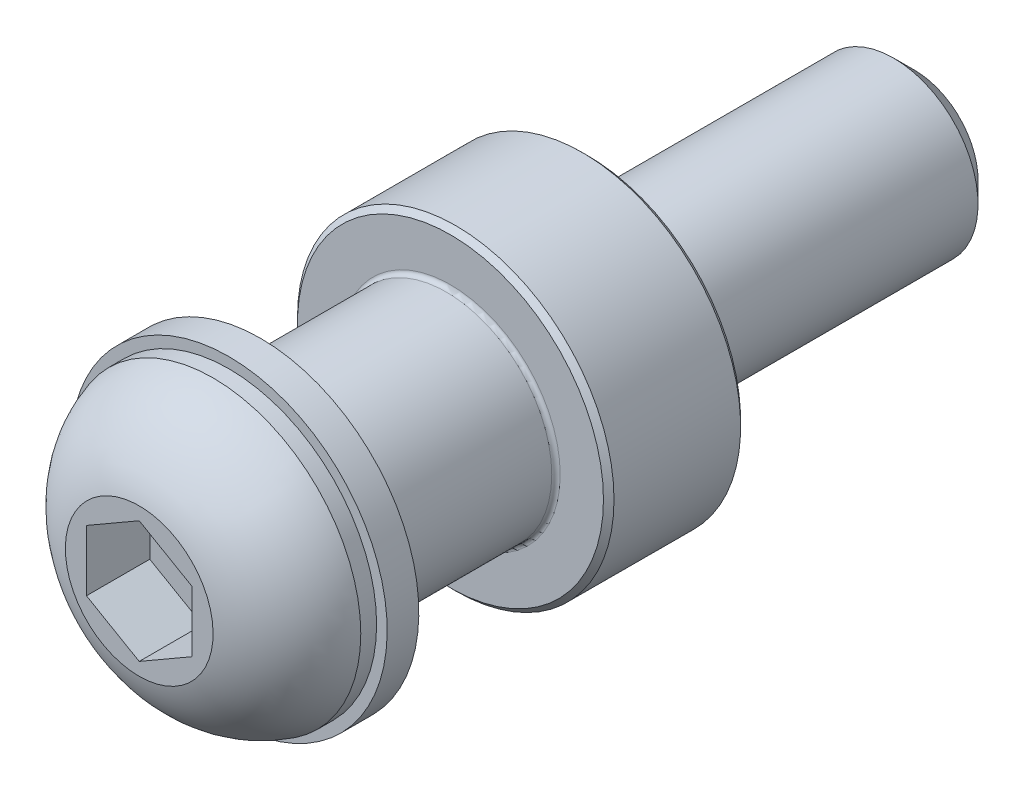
ISO-10303-21;
HEADER;
FILE_DESCRIPTION(('STEP AP214'),'2;1');
FILE_NAME('part.step','',(''),(''),'','','');
FILE_SCHEMA(('AUTOMOTIVE_DESIGN { 1 0 10303 214 1 1 1 1 }'));
ENDSEC;
DATA;
#1=APPLICATION_CONTEXT('core data for automotive mechanical design processes');
#2=APPLICATION_PROTOCOL_DEFINITION('international standard','automotive_design',2000,#1);
#3=PRODUCT_CONTEXT('',#1,'mechanical');
#4=PRODUCT('Part','Part','',(#3));
#5=PRODUCT_RELATED_PRODUCT_CATEGORY('part','',(#4));
#6=PRODUCT_DEFINITION_FORMATION('','',#4);
#7=PRODUCT_DEFINITION_CONTEXT('part definition',#1,'design');
#8=PRODUCT_DEFINITION('design','',#6,#7);
#9=PRODUCT_DEFINITION_SHAPE('','',#8);
#10=(LENGTH_UNIT() NAMED_UNIT(*) SI_UNIT(.MILLI.,.METRE.));
#11=(NAMED_UNIT(*) PLANE_ANGLE_UNIT() SI_UNIT($,.RADIAN.));
#12=(NAMED_UNIT(*) SI_UNIT($,.STERADIAN.) SOLID_ANGLE_UNIT());
#13=UNCERTAINTY_MEASURE_WITH_UNIT(LENGTH_MEASURE(1.E-05),#10,'distance_accuracy_value','');
#14=(GEOMETRIC_REPRESENTATION_CONTEXT(3) GLOBAL_UNCERTAINTY_ASSIGNED_CONTEXT((#13)) GLOBAL_UNIT_ASSIGNED_CONTEXT((#10,
#11,#12)) REPRESENTATION_CONTEXT('',''));
#15=CARTESIAN_POINT('',(0.,0.,0.));
#16=DIRECTION('',(0.,0.,1.));
#17=DIRECTION('',(1.,0.,0.));
#18=AXIS2_PLACEMENT_3D('',#15,#16,#17);
#19=CARTESIAN_POINT('',(0.,10.,13.));
#20=DIRECTION('',(0.,0.,1.));
#21=DIRECTION('',(1.,0.,0.));
#22=AXIS2_PLACEMENT_3D('',#19,#20,#21);
#23=PLANE('',#22);
#24=CARTESIAN_POINT('',(0.,0.,13.));
#25=DIRECTION('',(0.,0.,1.));
#26=DIRECTION('',(1.,0.,0.));
#27=AXIS2_PLACEMENT_3D('',#24,#25,#26);
#28=CIRCLE('',#27,14.5);
#29=CARTESIAN_POINT('',(14.5,0.,13.));
#30=VERTEX_POINT('',#29);
#31=EDGE_CURVE('E160',#30,#30,#28,.T.);
#32=ORIENTED_EDGE('',*,*,#31,.T.);
#33=EDGE_LOOP('',(#32));
#34=FACE_BOUND('',#33,.T.);
#35=CARTESIAN_POINT('',(0.,0.,13.));
#36=DIRECTION('',(0.,0.,1.));
#37=DIRECTION('',(1.,0.,0.));
#38=AXIS2_PLACEMENT_3D('',#35,#36,#37);
#39=CIRCLE('',#38,10.4);
#40=CARTESIAN_POINT('',(10.4,0.,13.));
#41=VERTEX_POINT('',#40);
#42=EDGE_CURVE('E143',#41,#41,#39,.F.);
#43=ORIENTED_EDGE('',*,*,#42,.T.);
#44=EDGE_LOOP('',(#43));
#45=FACE_BOUND('',#44,.T.);
#46=ADVANCED_FACE('F14',(#34,#45),#23,.T.);
#47=CARTESIAN_POINT('',(0.,0.,13.4));
#48=DIRECTION('',(0.,0.,1.));
#49=DIRECTION('',(1.,0.,0.));
#50=AXIS2_PLACEMENT_3D('',#47,#48,#49);
#51=TOROIDAL_SURFACE('',#50,10.4,0.4);
#52=CARTESIAN_POINT('',(0.,0.,13.4));
#53=DIRECTION('',(0.,0.,1.));
#54=DIRECTION('',(1.,0.,0.));
#55=AXIS2_PLACEMENT_3D('',#52,#53,#54);
#56=CIRCLE('',#55,10.);
#57=CARTESIAN_POINT('',(10.,0.,13.4));
#58=VERTEX_POINT('',#57);
#59=EDGE_CURVE('E148',#58,#58,#56,.T.);
#60=ORIENTED_EDGE('',*,*,#59,.F.);
#61=EDGE_LOOP('',(#60));
#62=FACE_BOUND('',#61,.T.);
#63=ORIENTED_EDGE('',*,*,#42,.F.);
#64=EDGE_LOOP('',(#63));
#65=FACE_BOUND('',#64,.T.);
#66=ADVANCED_FACE('F200',(#62,#65),#51,.F.);
#67=CARTESIAN_POINT('',(0.,0.,0.));
#68=DIRECTION('',(0.,0.,-1.));
#69=DIRECTION('',(-1.,0.,0.));
#70=AXIS2_PLACEMENT_3D('',#67,#68,#69);
#71=CYLINDRICAL_SURFACE('',#70,10.);
#72=CARTESIAN_POINT('',(0.,0.,30.));
#73=DIRECTION('',(0.,0.,1.));
#74=DIRECTION('',(1.,0.,0.));
#75=AXIS2_PLACEMENT_3D('',#72,#73,#74);
#76=CIRCLE('',#75,10.);
#77=CARTESIAN_POINT('',(10.,0.,30.));
#78=VERTEX_POINT('',#77);
#79=EDGE_CURVE('E23',#78,#78,#76,.F.);
#80=ORIENTED_EDGE('',*,*,#79,.T.);
#81=EDGE_LOOP('',(#80));
#82=FACE_BOUND('',#81,.T.);
#83=ORIENTED_EDGE('',*,*,#59,.T.);
#84=EDGE_LOOP('',(#83));
#85=FACE_BOUND('',#84,.T.);
#86=ADVANCED_FACE('F207',(#82,#85),#71,.T.);
#87=CARTESIAN_POINT('',(0.,0.,30.));
#88=DIRECTION('',(0.,0.,-1.));
#89=DIRECTION('',(-1.,0.,0.));
#90=AXIS2_PLACEMENT_3D('',#87,#88,#89);
#91=CONICAL_SURFACE('',#90,10.,0.785398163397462);
#92=CARTESIAN_POINT('',(0.,0.,30.5));
#93=DIRECTION('',(0.,0.,1.));
#94=DIRECTION('',(1.,0.,0.));
#95=AXIS2_PLACEMENT_3D('',#92,#93,#94);
#96=CIRCLE('',#95,9.5);
#97=CARTESIAN_POINT('',(9.5,0.,30.5));
#98=VERTEX_POINT('',#97);
#99=EDGE_CURVE('E9',#98,#98,#96,.T.);
#100=ORIENTED_EDGE('',*,*,#99,.F.);
#101=EDGE_LOOP('',(#100));
#102=FACE_BOUND('',#101,.T.);
#103=ORIENTED_EDGE('',*,*,#79,.F.);
#104=EDGE_LOOP('',(#103));
#105=FACE_BOUND('',#104,.T.);
#106=ADVANCED_FACE('F216',(#102,#105),#91,.T.);
#107=CARTESIAN_POINT('',(0.,8.2,30.5));
#108=DIRECTION('',(0.,0.,1.));
#109=DIRECTION('',(1.,0.,0.));
#110=AXIS2_PLACEMENT_3D('',#107,#108,#109);
#111=PLANE('',#110);
#112=ORIENTED_EDGE('',*,*,#99,.T.);
#113=EDGE_LOOP('',(#112));
#114=FACE_BOUND('',#113,.T.);
#115=CARTESIAN_POINT('',(0.,0.,30.5));
#116=DIRECTION('',(0.,0.,1.));
#117=DIRECTION('',(1.,0.,0.));
#118=AXIS2_PLACEMENT_3D('',#115,#116,#117);
#119=CIRCLE('',#118,8.);
#120=CARTESIAN_POINT('',(8.,0.,30.5));
#121=VERTEX_POINT('',#120);
#122=EDGE_CURVE('E138',#121,#121,#119,.F.);
#123=ORIENTED_EDGE('',*,*,#122,.T.);
#124=EDGE_LOOP('',(#123));
#125=FACE_BOUND('',#124,.T.);
#126=ADVANCED_FACE('F218',(#114,#125),#111,.T.);
#127=CARTESIAN_POINT('',(0.,0.,12.5));
#128=DIRECTION('',(0.,0.,-1.));
#129=DIRECTION('',(-1.,0.,0.));
#130=AXIS2_PLACEMENT_3D('',#127,#128,#129);
#131=CONICAL_SURFACE('',#130,15.,0.785398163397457);
#132=ORIENTED_EDGE('',*,*,#31,.F.);
#133=EDGE_LOOP('',(#132));
#134=FACE_BOUND('',#133,.T.);
#135=CARTESIAN_POINT('',(0.,0.,12.5));
#136=DIRECTION('',(0.,0.,1.));
#137=DIRECTION('',(1.,0.,0.));
#138=AXIS2_PLACEMENT_3D('',#135,#136,#137);
#139=CIRCLE('',#138,15.);
#140=CARTESIAN_POINT('',(15.,0.,12.5));
#141=VERTEX_POINT('',#140);
#142=EDGE_CURVE('E154',#141,#141,#139,.F.);
#143=ORIENTED_EDGE('',*,*,#142,.F.);
#144=EDGE_LOOP('',(#143));
#145=FACE_BOUND('',#144,.T.);
#146=ADVANCED_FACE('F221',(#134,#145),#131,.T.);
#147=CARTESIAN_POINT('',(0.,0.,0.));
#148=DIRECTION('',(0.,0.,-1.));
#149=DIRECTION('',(-1.,0.,0.));
#150=AXIS2_PLACEMENT_3D('',#147,#148,#149);
#151=CYLINDRICAL_SURFACE('',#150,15.);
#152=CARTESIAN_POINT('',(0.,0.,0.5));
#153=DIRECTION('',(0.,0.,-1.));
#154=DIRECTION('',(-1.,0.,0.));
#155=AXIS2_PLACEMENT_3D('',#152,#153,#154);
#156=CIRCLE('',#155,15.);
#157=CARTESIAN_POINT('',(-15.,0.,0.5));
#158=VERTEX_POINT('',#157);
#159=EDGE_CURVE('E157',#158,#158,#156,.F.);
#160=ORIENTED_EDGE('',*,*,#159,.T.);
#161=EDGE_LOOP('',(#160));
#162=FACE_BOUND('',#161,.T.);
#163=ORIENTED_EDGE('',*,*,#142,.T.);
#164=EDGE_LOOP('',(#163));
#165=FACE_BOUND('',#164,.T.);
#166=ADVANCED_FACE('F213',(#162,#165),#151,.T.);
#167=CARTESIAN_POINT('',(0.,0.,0.));
#168=DIRECTION('',(0.,0.,1.));
#169=DIRECTION('',(1.,0.,0.));
#170=AXIS2_PLACEMENT_3D('',#167,#168,#169);
#171=CONICAL_SURFACE('',#170,14.5,0.785398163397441);
#172=ORIENTED_EDGE('',*,*,#159,.F.);
#173=EDGE_LOOP('',(#172));
#174=FACE_BOUND('',#173,.T.);
#175=CARTESIAN_POINT('',(0.,0.,0.));
#176=DIRECTION('',(0.,0.,-1.));
#177=DIRECTION('',(-1.,0.,0.));
#178=AXIS2_PLACEMENT_3D('',#175,#176,#177);
#179=CIRCLE('',#178,14.5);
#180=CARTESIAN_POINT('',(-14.5,0.,0.));
#181=VERTEX_POINT('',#180);
#182=EDGE_CURVE('E151',#181,#181,#179,.T.);
#183=ORIENTED_EDGE('',*,*,#182,.F.);
#184=EDGE_LOOP('',(#183));
#185=FACE_BOUND('',#184,.T.);
#186=ADVANCED_FACE('F225',(#174,#185),#171,.T.);
#187=CARTESIAN_POINT('',(0.,15.,0.));
#188=DIRECTION('',(0.,0.,-1.));
#189=DIRECTION('',(-1.,0.,0.));
#190=AXIS2_PLACEMENT_3D('',#187,#188,#189);
#191=PLANE('',#190);
#192=ORIENTED_EDGE('',*,*,#182,.T.);
#193=EDGE_LOOP('',(#192));
#194=FACE_BOUND('',#193,.T.);
#195=CARTESIAN_POINT('',(0.,0.,0.));
#196=DIRECTION('',(0.,0.,-1.));
#197=DIRECTION('',(-1.,0.,0.));
#198=AXIS2_PLACEMENT_3D('',#195,#196,#197);
#199=CIRCLE('',#198,8.);
#200=CARTESIAN_POINT('',(-8.,0.,0.));
#201=VERTEX_POINT('',#200);
#202=EDGE_CURVE('E134',#201,#201,#199,.T.);
#203=ORIENTED_EDGE('',*,*,#202,.F.);
#204=EDGE_LOOP('',(#203));
#205=FACE_BOUND('',#204,.T.);
#206=ADVANCED_FACE('F198',(#194,#205),#191,.T.);
#207=CARTESIAN_POINT('',(-5.,-8.66025403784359,36.5));
#208=DIRECTION('',(0.,0.,1.));
#209=DIRECTION('',(0.,-1.,0.));
#210=AXIS2_PLACEMENT_3D('',#207,#208,#209);
#211=PLANE('',#210);
#212=DIRECTION('',(-0.86602540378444,-0.5,0.));
#213=VECTOR('',#212,1.);
#214=CARTESIAN_POINT('',(5.,-2.88675134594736,36.5));
#215=LINE('',#214,#213);
#216=CARTESIAN_POINT('',(5.,-2.88675134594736,36.5));
#217=VERTEX_POINT('',#216);
#218=CARTESIAN_POINT('',(0.,-5.77350269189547,36.5));
#219=VERTEX_POINT('',#218);
#220=EDGE_CURVE('E68',#217,#219,#215,.T.);
#221=ORIENTED_EDGE('',*,*,#220,.F.);
#222=DIRECTION('',(0.,-1.,0.));
#223=VECTOR('',#222,1.);
#224=CARTESIAN_POINT('',(5.,2.88675134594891,36.5));
#225=LINE('',#224,#223);
#226=CARTESIAN_POINT('',(5.,2.88675134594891,36.5));
#227=VERTEX_POINT('',#226);
#228=EDGE_CURVE('E114',#227,#217,#225,.T.);
#229=ORIENTED_EDGE('',*,*,#228,.F.);
#230=DIRECTION('',(-0.86602540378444,0.5,0.));
#231=VECTOR('',#230,1.);
#232=CARTESIAN_POINT('',(5.,2.88675134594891,36.5));
#233=LINE('',#232,#231);
#234=CARTESIAN_POINT('',(0.,5.77350269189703,36.5));
#235=VERTEX_POINT('',#234);
#236=EDGE_CURVE('E111',#227,#235,#233,.T.);
#237=ORIENTED_EDGE('',*,*,#236,.T.);
#238=DIRECTION('',(0.86602540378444,0.5,0.));
#239=VECTOR('',#238,1.);
#240=CARTESIAN_POINT('',(-5.,2.88675134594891,36.5));
#241=LINE('',#240,#239);
#242=CARTESIAN_POINT('',(-5.,2.88675134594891,36.5));
#243=VERTEX_POINT('',#242);
#244=EDGE_CURVE('E108',#243,#235,#241,.T.);
#245=ORIENTED_EDGE('',*,*,#244,.F.);
#246=DIRECTION('',(0.,-1.,0.));
#247=VECTOR('',#246,1.);
#248=CARTESIAN_POINT('',(-5.,2.88675134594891,36.5));
#249=LINE('',#248,#247);
#250=CARTESIAN_POINT('',(-5.,-2.88675134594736,36.5));
#251=VERTEX_POINT('',#250);
#252=EDGE_CURVE('E105',#243,#251,#249,.T.);
#253=ORIENTED_EDGE('',*,*,#252,.T.);
#254=DIRECTION('',(0.86602540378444,-0.5,0.));
#255=VECTOR('',#254,1.);
#256=CARTESIAN_POINT('',(-5.,-2.88675134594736,36.5));
#257=LINE('',#256,#255);
#258=EDGE_CURVE('E103',#251,#219,#257,.T.);
#259=ORIENTED_EDGE('',*,*,#258,.T.);
#260=EDGE_LOOP('',(#221,#229,#237,#245,#253,#259));
#261=FACE_BOUND('',#260,.T.);
#262=ADVANCED_FACE('F224',(#261),#211,.T.);
#263=CARTESIAN_POINT('',(5.,2.88675134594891,36.5));
#264=DIRECTION('',(0.5,0.86602540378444,0.));
#265=DIRECTION('',(-0.86602540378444,0.5,0.));
#266=AXIS2_PLACEMENT_3D('',#263,#264,#265);
#267=PLANE('',#266);
#268=DIRECTION('',(0.,0.,1.));
#269=VECTOR('',#268,1.);
#270=CARTESIAN_POINT('',(5.,2.88675134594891,36.5));
#271=LINE('',#270,#269);
#272=CARTESIAN_POINT('',(5.,2.88675134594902,42.5));
#273=VERTEX_POINT('',#272);
#274=EDGE_CURVE('E118',#227,#273,#271,.T.);
#275=ORIENTED_EDGE('',*,*,#274,.T.);
#276=DIRECTION('',(-0.86602540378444,0.5,0.));
#277=VECTOR('',#276,1.);
#278=CARTESIAN_POINT('',(5.,2.88675134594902,42.5));
#279=LINE('',#278,#277);
#280=CARTESIAN_POINT('',(0.,5.77350269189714,42.5));
#281=VERTEX_POINT('',#280);
#282=EDGE_CURVE('E98',#273,#281,#279,.T.);
#283=ORIENTED_EDGE('',*,*,#282,.T.);
#284=DIRECTION('',(0.,0.,1.));
#285=VECTOR('',#284,1.);
#286=CARTESIAN_POINT('',(0.,5.77350269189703,36.5));
#287=LINE('',#286,#285);
#288=EDGE_CURVE('E120',#235,#281,#287,.T.);
#289=ORIENTED_EDGE('',*,*,#288,.F.);
#290=ORIENTED_EDGE('',*,*,#236,.F.);
#291=EDGE_LOOP('',(#275,#283,#289,#290));
#292=FACE_BOUND('',#291,.T.);
#293=ADVANCED_FACE('F251',(#292),#267,.F.);
#294=CARTESIAN_POINT('',(-5.,2.88675134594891,36.5));
#295=DIRECTION('',(0.5,-0.86602540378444,0.));
#296=DIRECTION('',(0.86602540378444,0.5,0.));
#297=AXIS2_PLACEMENT_3D('',#294,#295,#296);
#298=PLANE('',#297);
#299=ORIENTED_EDGE('',*,*,#288,.T.);
#300=DIRECTION('',(0.86602540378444,0.5,0.));
#301=VECTOR('',#300,1.);
#302=CARTESIAN_POINT('',(-5.,2.88675134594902,42.5));
#303=LINE('',#302,#301);
#304=CARTESIAN_POINT('',(-5.,2.88675134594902,42.5));
#305=VERTEX_POINT('',#304);
#306=EDGE_CURVE('E95',#305,#281,#303,.T.);
#307=ORIENTED_EDGE('',*,*,#306,.F.);
#308=DIRECTION('',(0.,0.,1.));
#309=VECTOR('',#308,1.);
#310=CARTESIAN_POINT('',(-5.,2.88675134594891,36.5));
#311=LINE('',#310,#309);
#312=EDGE_CURVE('E122',#243,#305,#311,.T.);
#313=ORIENTED_EDGE('',*,*,#312,.F.);
#314=ORIENTED_EDGE('',*,*,#244,.T.);
#315=EDGE_LOOP('',(#299,#307,#313,#314));
#316=FACE_BOUND('',#315,.T.);
#317=ADVANCED_FACE('F260',(#316),#298,.T.);
#318=CARTESIAN_POINT('',(-5.,2.88675134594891,36.5));
#319=DIRECTION('',(-1.,0.,0.));
#320=DIRECTION('',(0.,-1.,0.));
#321=AXIS2_PLACEMENT_3D('',#318,#319,#320);
#322=PLANE('',#321);
#323=ORIENTED_EDGE('',*,*,#312,.T.);
#324=DIRECTION('',(0.,-1.,0.));
#325=VECTOR('',#324,1.);
#326=CARTESIAN_POINT('',(-5.,2.88675134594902,42.5));
#327=LINE('',#326,#325);
#328=CARTESIAN_POINT('',(-5.,-2.88675134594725,42.5));
#329=VERTEX_POINT('',#328);
#330=EDGE_CURVE('E81',#305,#329,#327,.T.);
#331=ORIENTED_EDGE('',*,*,#330,.T.);
#332=DIRECTION('',(0.,0.,1.));
#333=VECTOR('',#332,1.);
#334=CARTESIAN_POINT('',(-5.,-2.88675134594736,36.5));
#335=LINE('',#334,#333);
#336=EDGE_CURVE('E73',#251,#329,#335,.T.);
#337=ORIENTED_EDGE('',*,*,#336,.F.);
#338=ORIENTED_EDGE('',*,*,#252,.F.);
#339=EDGE_LOOP('',(#323,#331,#337,#338));
#340=FACE_BOUND('',#339,.T.);
#341=ADVANCED_FACE('F264',(#340),#322,.F.);
#342=CARTESIAN_POINT('',(-5.,-2.88675134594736,36.5));
#343=DIRECTION('',(-0.5,-0.86602540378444,0.));
#344=DIRECTION('',(0.86602540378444,-0.5,0.));
#345=AXIS2_PLACEMENT_3D('',#342,#343,#344);
#346=PLANE('',#345);
#347=ORIENTED_EDGE('',*,*,#336,.T.);
#348=DIRECTION('',(0.86602540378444,-0.5,0.));
#349=VECTOR('',#348,1.);
#350=CARTESIAN_POINT('',(-5.,-2.88675134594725,42.5));
#351=LINE('',#350,#349);
#352=CARTESIAN_POINT('',(0.,-5.77350269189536,42.5));
#353=VERTEX_POINT('',#352);
#354=EDGE_CURVE('E76',#329,#353,#351,.T.);
#355=ORIENTED_EDGE('',*,*,#354,.T.);
#356=DIRECTION('',(0.,0.,1.));
#357=VECTOR('',#356,1.);
#358=CARTESIAN_POINT('',(0.,-5.77350269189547,36.5));
#359=LINE('',#358,#357);
#360=EDGE_CURVE('E65',#219,#353,#359,.T.);
#361=ORIENTED_EDGE('',*,*,#360,.F.);
#362=ORIENTED_EDGE('',*,*,#258,.F.);
#363=EDGE_LOOP('',(#347,#355,#361,#362));
#364=FACE_BOUND('',#363,.T.);
#365=ADVANCED_FACE('F77',(#364),#346,.F.);
#366=CARTESIAN_POINT('',(5.,-2.88675134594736,36.5));
#367=DIRECTION('',(-0.5,0.86602540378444,0.));
#368=DIRECTION('',(-0.86602540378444,-0.5,0.));
#369=AXIS2_PLACEMENT_3D('',#366,#367,#368);
#370=PLANE('',#369);
#371=ORIENTED_EDGE('',*,*,#360,.T.);
#372=DIRECTION('',(-0.86602540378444,-0.5,0.));
#373=VECTOR('',#372,1.);
#374=CARTESIAN_POINT('',(5.,-2.88675134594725,42.5));
#375=LINE('',#374,#373);
#376=CARTESIAN_POINT('',(5.,-2.88675134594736,42.5));
#377=VERTEX_POINT('',#376);
#378=EDGE_CURVE('E31',#377,#353,#375,.T.);
#379=ORIENTED_EDGE('',*,*,#378,.F.);
#380=DIRECTION('',(0.,0.,1.));
#381=VECTOR('',#380,1.);
#382=CARTESIAN_POINT('',(5.,-2.88675134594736,36.5));
#383=LINE('',#382,#381);
#384=EDGE_CURVE('E35',#217,#377,#383,.T.);
#385=ORIENTED_EDGE('',*,*,#384,.F.);
#386=ORIENTED_EDGE('',*,*,#220,.T.);
#387=EDGE_LOOP('',(#371,#379,#385,#386));
#388=FACE_BOUND('',#387,.T.);
#389=ADVANCED_FACE('F67',(#388),#370,.T.);
#390=CARTESIAN_POINT('',(5.,2.88675134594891,36.5));
#391=DIRECTION('',(-1.,0.,0.));
#392=DIRECTION('',(0.,-1.,0.));
#393=AXIS2_PLACEMENT_3D('',#390,#391,#392);
#394=PLANE('',#393);
#395=ORIENTED_EDGE('',*,*,#228,.T.);
#396=ORIENTED_EDGE('',*,*,#384,.T.);
#397=DIRECTION('',(0.,-1.,0.));
#398=VECTOR('',#397,1.);
#399=CARTESIAN_POINT('',(5.,2.88675134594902,42.5));
#400=LINE('',#399,#398);
#401=EDGE_CURVE('E87',#273,#377,#400,.T.);
#402=ORIENTED_EDGE('',*,*,#401,.F.);
#403=ORIENTED_EDGE('',*,*,#274,.F.);
#404=EDGE_LOOP('',(#395,#396,#402,#403));
#405=FACE_BOUND('',#404,.T.);
#406=ADVANCED_FACE('F195',(#405),#394,.T.);
#407=CARTESIAN_POINT('',(0.,1.6866369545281E-13,42.5));
#408=DIRECTION('',(0.,0.,1.));
#409=DIRECTION('',(0.,-1.,0.));
#410=AXIS2_PLACEMENT_3D('',#407,#408,#409);
#411=PLANE('',#410);
#412=CARTESIAN_POINT('',(0.,1.07421355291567E-12,42.5));
#413=DIRECTION('',(0.,0.,1.));
#414=DIRECTION('',(0.,-1.,0.));
#415=AXIS2_PLACEMENT_3D('',#412,#413,#414);
#416=CIRCLE('',#415,6.99999999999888);
#417=CARTESIAN_POINT('',(0.,-6.99999999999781,42.5000000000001));
#418=VERTEX_POINT('',#417);
#419=EDGE_CURVE('E72',#418,#418,#416,.T.);
#420=ORIENTED_EDGE('',*,*,#419,.T.);
#421=EDGE_LOOP('',(#420));
#422=FACE_BOUND('',#421,.T.);
#423=ORIENTED_EDGE('',*,*,#401,.T.);
#424=ORIENTED_EDGE('',*,*,#378,.T.);
#425=ORIENTED_EDGE('',*,*,#354,.F.);
#426=ORIENTED_EDGE('',*,*,#330,.F.);
#427=ORIENTED_EDGE('',*,*,#306,.T.);
#428=ORIENTED_EDGE('',*,*,#282,.F.);
#429=EDGE_LOOP('',(#423,#424,#425,#426,#427,#428));
#430=FACE_BOUND('',#429,.T.);
#431=ADVANCED_FACE('F84',(#422,#430),#411,.T.);
#432=CARTESIAN_POINT('',(0.,8.93778108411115E-13,32.8558971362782));
#433=DIRECTION('',(0.,0.,1.));
#434=DIRECTION('',(0.,-1.,0.));
#435=AXIS2_PLACEMENT_3D('',#432,#433,#434);
#436=DEGENERATE_TOROIDAL_SURFACE('',#435,4.35589713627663,10.,.T.);
#437=ORIENTED_EDGE('',*,*,#419,.F.);
#438=EDGE_LOOP('',(#437));
#439=FACE_BOUND('',#438,.T.);
#440=CARTESIAN_POINT('',(0.,9.43515635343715E-13,35.5));
#441=DIRECTION('',(0.,0.,1.));
#442=DIRECTION('',(0.,-1.,0.));
#443=AXIS2_PLACEMENT_3D('',#440,#441,#442);
#444=CIRCLE('',#443,13.9999999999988);
#445=CARTESIAN_POINT('',(0.,-13.9999999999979,35.5000000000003));
#446=VERTEX_POINT('',#445);
#447=EDGE_CURVE('E127',#446,#446,#444,.T.);
#448=ORIENTED_EDGE('',*,*,#447,.T.);
#449=EDGE_LOOP('',(#448));
#450=FACE_BOUND('',#449,.T.);
#451=ADVANCED_FACE('F183',(#439,#450),#436,.T.);
#452=CARTESIAN_POINT('',(0.,1.29220939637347E-12,54.17555637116));
#453=DIRECTION('',(0.,0.,1.));
#454=DIRECTION('',(0.,-1.,0.));
#455=AXIS2_PLACEMENT_3D('',#452,#453,#454);
#456=CYLINDRICAL_SURFACE('',#455,13.9999999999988);
#457=ORIENTED_EDGE('',*,*,#447,.F.);
#458=EDGE_LOOP('',(#457));
#459=FACE_BOUND('',#458,.T.);
#460=CARTESIAN_POINT('',(0.,9.15508938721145E-13,34.));
#461=DIRECTION('',(0.,0.,-1.));
#462=DIRECTION('',(0.,1.,0.));
#463=AXIS2_PLACEMENT_3D('',#460,#461,#462);
#464=CIRCLE('',#463,13.9999999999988);
#465=CARTESIAN_POINT('',(0.,13.9999999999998,33.9999999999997));
#466=VERTEX_POINT('',#465);
#467=EDGE_CURVE('E90',#466,#466,#464,.T.);
#468=ORIENTED_EDGE('',*,*,#467,.F.);
#469=EDGE_LOOP('',(#468));
#470=FACE_BOUND('',#469,.T.);
#471=ADVANCED_FACE('F176',(#459,#470),#456,.T.);
#472=CARTESIAN_POINT('',(0.,9.15508938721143E-13,34.));
#473=DIRECTION('',(0.,0.,-1.));
#474=DIRECTION('',(0.,1.,0.));
#475=AXIS2_PLACEMENT_3D('',#472,#473,#474);
#476=PLANE('',#475);
#477=CARTESIAN_POINT('',(0.,9.15508938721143E-13,34.));
#478=DIRECTION('',(0.,0.,-1.));
#479=DIRECTION('',(0.,1.,0.));
#480=AXIS2_PLACEMENT_3D('',#477,#478,#479);
#481=CIRCLE('',#480,15.);
#482=CARTESIAN_POINT('',(0.,15.0000000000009,33.9999999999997));
#483=VERTEX_POINT('',#482);
#484=EDGE_CURVE('E167',#483,#483,#481,.T.);
#485=ORIENTED_EDGE('',*,*,#484,.F.);
#486=EDGE_LOOP('',(#485));
#487=FACE_BOUND('',#486,.T.);
#488=ORIENTED_EDGE('',*,*,#467,.T.);
#489=EDGE_LOOP('',(#488));
#490=FACE_BOUND('',#489,.T.);
#491=ADVANCED_FACE('F173',(#487,#490),#476,.F.);
#492=CARTESIAN_POINT('',(0.,8.59495545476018E-13,31.));
#493=DIRECTION('',(0.,0.,1.));
#494=DIRECTION('',(0.,-1.,0.));
#495=AXIS2_PLACEMENT_3D('',#492,#493,#494);
#496=CYLINDRICAL_SURFACE('',#495,15.);
#497=CARTESIAN_POINT('',(0.,8.59495545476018E-13,31.));
#498=DIRECTION('',(0.,0.,-1.));
#499=DIRECTION('',(0.,1.,0.));
#500=AXIS2_PLACEMENT_3D('',#497,#498,#499);
#501=CIRCLE('',#500,15.);
#502=CARTESIAN_POINT('',(0.,15.0000000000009,30.9999999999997));
#503=VERTEX_POINT('',#502);
#504=EDGE_CURVE('E165',#503,#503,#501,.T.);
#505=ORIENTED_EDGE('',*,*,#504,.F.);
#506=EDGE_LOOP('',(#505));
#507=FACE_BOUND('',#506,.T.);
#508=ORIENTED_EDGE('',*,*,#484,.T.);
#509=EDGE_LOOP('',(#508));
#510=FACE_BOUND('',#509,.T.);
#511=ADVANCED_FACE('F171',(#507,#510),#496,.T.);
#512=CARTESIAN_POINT('',(0.,8.59495545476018E-13,31.));
#513=DIRECTION('',(0.,0.,-1.));
#514=DIRECTION('',(0.,1.,0.));
#515=AXIS2_PLACEMENT_3D('',#512,#513,#514);
#516=PLANE('',#515);
#517=ORIENTED_EDGE('',*,*,#504,.T.);
#518=EDGE_LOOP('',(#517));
#519=FACE_BOUND('',#518,.T.);
#520=CARTESIAN_POINT('',(0.,8.59495545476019E-13,31.));
#521=DIRECTION('',(0.,0.,-1.));
#522=DIRECTION('',(0.,1.,0.));
#523=AXIS2_PLACEMENT_3D('',#520,#521,#522);
#524=CIRCLE('',#523,7.99999999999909);
#525=CARTESIAN_POINT('',(0.,7.99999999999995,30.9999999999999));
#526=VERTEX_POINT('',#525);
#527=EDGE_CURVE('E18',#526,#526,#524,.T.);
#528=ORIENTED_EDGE('',*,*,#527,.F.);
#529=EDGE_LOOP('',(#528));
#530=FACE_BOUND('',#529,.T.);
#531=ADVANCED_FACE('F178',(#519,#530),#516,.T.);
#532=CARTESIAN_POINT('',(0.,1.29220939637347E-12,54.17555637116));
#533=DIRECTION('',(0.,0.,1.));
#534=DIRECTION('',(0.,-1.,0.));
#535=AXIS2_PLACEMENT_3D('',#532,#533,#534);
#536=CYLINDRICAL_SURFACE('',#535,7.99999999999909);
#537=ORIENTED_EDGE('',*,*,#122,.F.);
#538=EDGE_LOOP('',(#537));
#539=FACE_BOUND('',#538,.T.);
#540=ORIENTED_EDGE('',*,*,#527,.T.);
#541=EDGE_LOOP('',(#540));
#542=FACE_BOUND('',#541,.T.);
#543=ADVANCED_FACE('F238',(#539,#542),#536,.T.);
#544=CARTESIAN_POINT('',(0.,-2.98114581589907E-13,-31.));
#545=DIRECTION('',(0.,0.,-1.));
#546=DIRECTION('',(0.,1.,0.));
#547=AXIS2_PLACEMENT_3D('',#544,#545,#546);
#548=PLANE('',#547);
#549=CARTESIAN_POINT('',(0.,-2.98114581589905E-13,-31.));
#550=DIRECTION('',(0.,0.,-1.));
#551=DIRECTION('',(0.,1.,0.));
#552=AXIS2_PLACEMENT_3D('',#549,#550,#551);
#553=CIRCLE('',#552,5.99999999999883);
#554=CARTESIAN_POINT('',(0.,5.99999999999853,-31.0000000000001));
#555=VERTEX_POINT('',#554);
#556=EDGE_CURVE('E130',#555,#555,#553,.T.);
#557=ORIENTED_EDGE('',*,*,#556,.T.);
#558=EDGE_LOOP('',(#557));
#559=FACE_BOUND('',#558,.T.);
#560=ADVANCED_FACE('F244',(#559),#548,.T.);
#561=CARTESIAN_POINT('',(0.,-2.98114581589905E-13,-31.));
#562=DIRECTION('',(0.,0.,1.));
#563=DIRECTION('',(0.,-1.,0.));
#564=AXIS2_PLACEMENT_3D('',#561,#562,#563);
#565=CONICAL_SURFACE('',#564,5.99999999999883,0.785398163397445);
#566=CARTESIAN_POINT('',(0.,-2.60772319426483E-13,-29.));
#567=DIRECTION('',(0.,0.,-1.));
#568=DIRECTION('',(0.,1.,0.));
#569=AXIS2_PLACEMENT_3D('',#566,#567,#568);
#570=CIRCLE('',#569,7.99999999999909);
#571=CARTESIAN_POINT('',(0.,7.99999999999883,-29.0000000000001));
#572=VERTEX_POINT('',#571);
#573=EDGE_CURVE('E132',#572,#572,#570,.F.);
#574=ORIENTED_EDGE('',*,*,#573,.F.);
#575=EDGE_LOOP('',(#574));
#576=FACE_BOUND('',#575,.T.);
#577=ORIENTED_EDGE('',*,*,#556,.F.);
#578=EDGE_LOOP('',(#577));
#579=FACE_BOUND('',#578,.T.);
#580=ADVANCED_FACE('F16',(#576,#579),#565,.T.);
#581=ORIENTED_EDGE('',*,*,#202,.T.);
#582=EDGE_LOOP('',(#581));
#583=FACE_BOUND('',#582,.T.);
#584=ORIENTED_EDGE('',*,*,#573,.T.);
#585=EDGE_LOOP('',(#584));
#586=FACE_BOUND('',#585,.T.);
#587=ADVANCED_FACE('F248',(#583,#586),#536,.T.);
#588=CLOSED_SHELL('',(#46,#66,#86,#106,#126,#146,#166,#186,#206,#262,#293,#317,#341,#365,#389,
#406,#431,#451,#471,#491,#511,#531,#543,#560,#580,#587));
#589=MANIFOLD_SOLID_BREP('B1',#588);
#590=ADVANCED_BREP_SHAPE_REPRESENTATION('',(#18,#589),#14);
#591=SHAPE_DEFINITION_REPRESENTATION(#9,#590);
ENDSEC;
END-ISO-10303-21;
